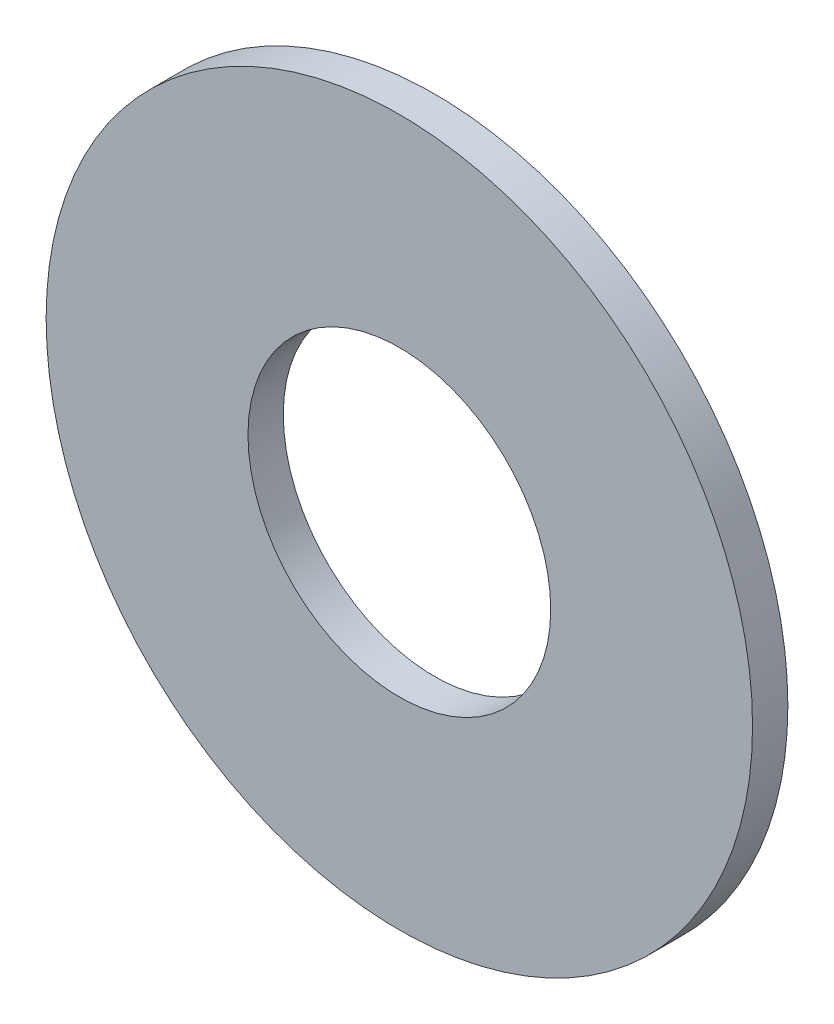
from build123d import *

# Parameters (mm, degrees)
ESQUISSE1_R          = 14
ESQUISSE1_R_2        = 6
BASE_EXTRUSION_DEPTH = 1.4


with BuildPart() as part:
    # Esquisse1 → Base-Extrusion (new body)
    with BuildSketch(Plane.XY):
        with Locations((45, 0)):
            Circle(ESQUISSE1_R)
        with Locations((45, 0)):
            Circle(ESQUISSE1_R_2, mode=Mode.SUBTRACT)
    extrude(amount=BASE_EXTRUSION_DEPTH)


solid = part.part
